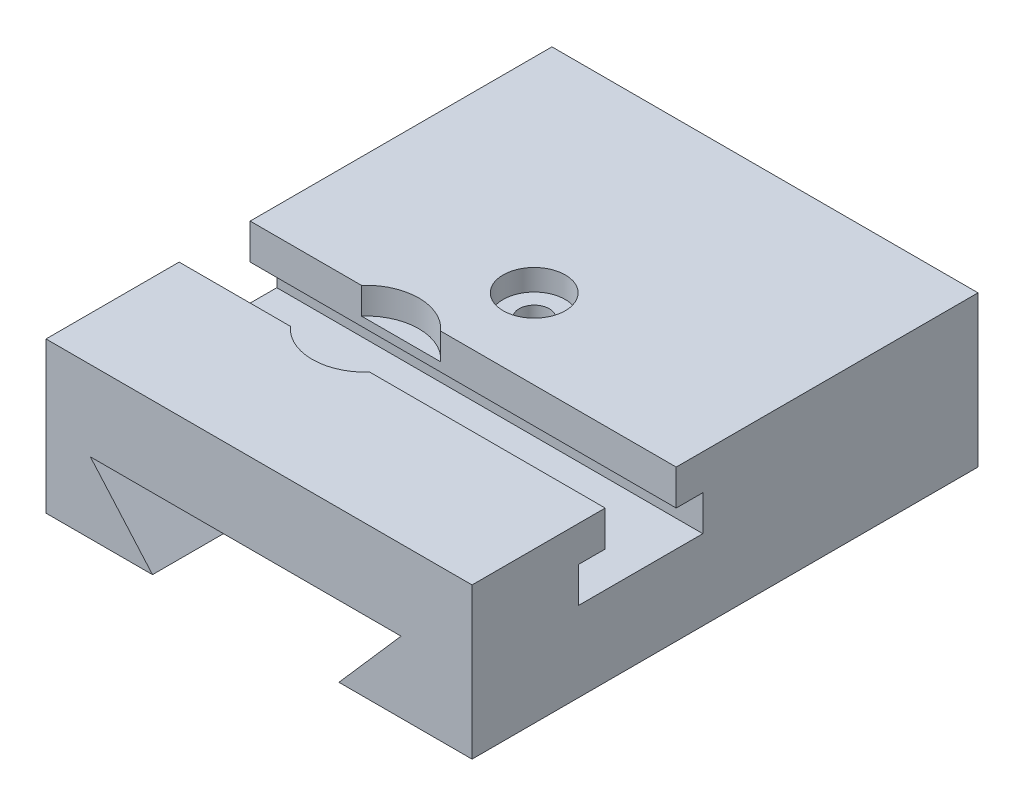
from build123d import *

# Parameters (mm, degrees)
SCHIZZO1_W                                           = 48
SCHIZZO1_H                                           = 57
ESTRUSIONE_ESTRUSIONE1_DEPTH                         = 17
TAGLIO_ESTRUSIONE1_REACH                             = 60.355
SCHIZZO4_R                                           = 6
TAGLIO_ESTRUSIONE3_DEPTH                             = 3
TAGLIO_ESTRUSIONE4_REACH                             = 66.14
FORO_LAMATO_PER_VITE_M3_A_TESTA_CILINDRI_D           = 3.4
FORO_LAMATO_PER_VITE_M3_A_TESTA_CILINDRI_CBORE_D     = 7
FORO_LAMATO_PER_VITE_M3_A_TESTA_CILINDRI_CBORE_DEPTH = 2.4


with BuildPart() as part:
    # Schizzo1 → Estrusione-Estrusione1 (new body)
    with BuildSketch(Plane(origin=(0, 0, 0), x_dir=(1, 0, 0), z_dir=(0, 1, 0))):
        Rectangle(SCHIZZO1_W, SCHIZZO1_H)
    extrude(amount=ESTRUSIONE_ESTRUSIONE1_DEPTH)

    # Schizzo2 → Taglio-Estrusione1 (cut, up to next)
    with BuildSketch(Plane(origin=(24, 0, 0), x_dir=(0, 0, -1), z_dir=(1, 0, 0)), mode=Mode.PRIVATE) as taglio_estrusione1_sk1:
        Polygon((-13.5, 17), (-13.5, 13), (-16.5, 13), (-16.5, 9), (-2.5, 9), (-2.5, 13), (-5.5, 13), (-5.5, 17), align=None)
    taglio_estrusione1_tool1 = extrude(taglio_estrusione1_sk1.sketch, amount=-TAGLIO_ESTRUSIONE1_REACH, mode=Mode.PRIVATE) & part.part
    add(taglio_estrusione1_tool1.solids().sort_by_distance((24, 12.454545, 9.5))[0], mode=Mode.SUBTRACT)

    # Schizzo4 → Taglio-Estrusione3 (cut)
    with BuildSketch(Plane(origin=(0, 17, 0), x_dir=(1, 0, 0), z_dir=(0, 1, 0))):
        with Locations((-7, -9.5)):
            Circle(SCHIZZO4_R)
    extrude(amount=-TAGLIO_ESTRUSIONE3_DEPTH, mode=Mode.SUBTRACT)

    # Schizzo5 → Taglio-Estrusione4 (cut, up to next)
    with BuildSketch(Plane.XY.offset(28.5), mode=Mode.PRIVATE) as taglio_estrusione4_sk1:
        Polygon((9, 0), (16, 8), (-19, 8), (-12, 0), align=None)
    taglio_estrusione4_tool1 = extrude(taglio_estrusione4_sk1.sketch, amount=-TAGLIO_ESTRUSIONE4_REACH, mode=Mode.PRIVATE) & part.part
    add(taglio_estrusione4_tool1.solids().sort_by_distance((-1.5, 4.333333, 28.5))[0], mode=Mode.SUBTRACT)

    # Foro lamato per Vite M3 a testa cilindri (through all)
    with Locations(Plane(origin=(0, 17, 0), x_dir=(1, 0, 0), z_dir=(0, 1, 0))):
        with Locations((-1, 3.5)):
            CounterBoreHole(FORO_LAMATO_PER_VITE_M3_A_TESTA_CILINDRI_D / 2, FORO_LAMATO_PER_VITE_M3_A_TESTA_CILINDRI_CBORE_D / 2, FORO_LAMATO_PER_VITE_M3_A_TESTA_CILINDRI_CBORE_DEPTH)


solid = part.part
